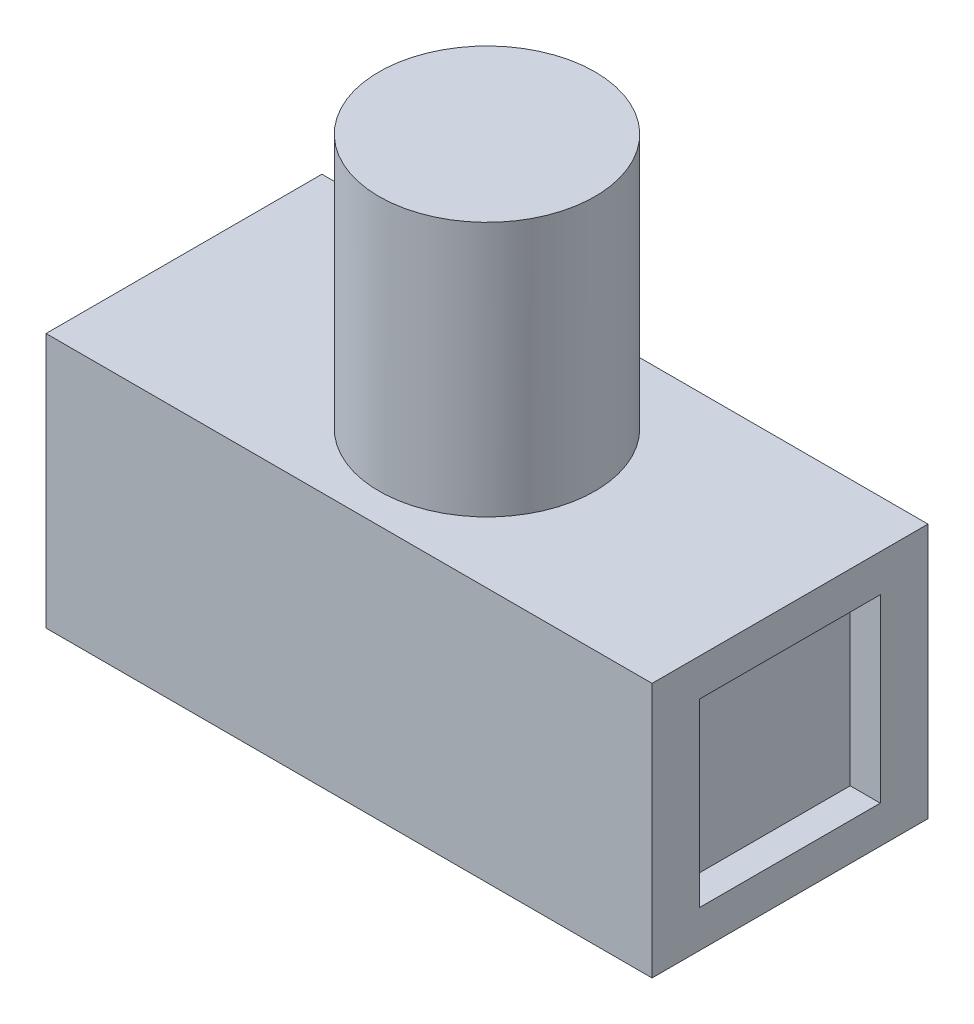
ISO-10303-21;
HEADER;
FILE_DESCRIPTION(('STEP AP214'),'2;1');
FILE_NAME('part.step','',(''),(''),'','','');
FILE_SCHEMA(('AUTOMOTIVE_DESIGN { 1 0 10303 214 1 1 1 1 }'));
ENDSEC;
DATA;
#1=APPLICATION_CONTEXT('core data for automotive mechanical design processes');
#2=APPLICATION_PROTOCOL_DEFINITION('international standard','automotive_design',2000,#1);
#3=PRODUCT_CONTEXT('',#1,'mechanical');
#4=PRODUCT('Part','Part','',(#3));
#5=PRODUCT_RELATED_PRODUCT_CATEGORY('part','',(#4));
#6=PRODUCT_DEFINITION_FORMATION('','',#4);
#7=PRODUCT_DEFINITION_CONTEXT('part definition',#1,'design');
#8=PRODUCT_DEFINITION('design','',#6,#7);
#9=PRODUCT_DEFINITION_SHAPE('','',#8);
#10=(LENGTH_UNIT() NAMED_UNIT(*) SI_UNIT(.MILLI.,.METRE.));
#11=(NAMED_UNIT(*) PLANE_ANGLE_UNIT() SI_UNIT($,.RADIAN.));
#12=(NAMED_UNIT(*) SI_UNIT($,.STERADIAN.) SOLID_ANGLE_UNIT());
#13=UNCERTAINTY_MEASURE_WITH_UNIT(LENGTH_MEASURE(1.E-05),#10,'distance_accuracy_value','');
#14=(GEOMETRIC_REPRESENTATION_CONTEXT(3) GLOBAL_UNCERTAINTY_ASSIGNED_CONTEXT((#13)) GLOBAL_UNIT_ASSIGNED_CONTEXT((#10,
#11,#12)) REPRESENTATION_CONTEXT('',''));
#15=CARTESIAN_POINT('',(0.,0.,0.));
#16=DIRECTION('',(0.,0.,1.));
#17=DIRECTION('',(1.,0.,0.));
#18=AXIS2_PLACEMENT_3D('',#15,#16,#17);
#19=CARTESIAN_POINT('',(0.,53.848,0.));
#20=DIRECTION('',(0.,-1.,0.));
#21=DIRECTION('',(0.,0.,-1.));
#22=AXIS2_PLACEMENT_3D('',#19,#20,#21);
#23=PLANE('',#22);
#24=DIRECTION('',(0.,0.,1.));
#25=VECTOR('',#24,1.);
#26=CARTESIAN_POINT('',(-63.9482717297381,53.848,29.1126373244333));
#27=LINE('',#26,#25);
#28=CARTESIAN_POINT('',(-63.9482717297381,53.848,-29.1126373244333));
#29=VERTEX_POINT('',#28);
#30=CARTESIAN_POINT('',(-63.9482717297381,53.848,29.1126373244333));
#31=VERTEX_POINT('',#30);
#32=EDGE_CURVE('E152',#29,#31,#27,.T.);
#33=ORIENTED_EDGE('',*,*,#32,.T.);
#34=DIRECTION('',(1.,0.,0.));
#35=VECTOR('',#34,1.);
#36=CARTESIAN_POINT('',(-63.9482717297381,53.848,29.1126373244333));
#37=LINE('',#36,#35);
#38=CARTESIAN_POINT('',(63.9482717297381,53.848,29.1126373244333));
#39=VERTEX_POINT('',#38);
#40=EDGE_CURVE('E88',#31,#39,#37,.T.);
#41=ORIENTED_EDGE('',*,*,#40,.T.);
#42=DIRECTION('',(0.,0.,-1.));
#43=VECTOR('',#42,1.);
#44=CARTESIAN_POINT('',(63.9482717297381,53.848,29.1126373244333));
#45=LINE('',#44,#43);
#46=CARTESIAN_POINT('',(63.9482717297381,53.848,-29.1126373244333));
#47=VERTEX_POINT('',#46);
#48=EDGE_CURVE('E155',#39,#47,#45,.T.);
#49=ORIENTED_EDGE('',*,*,#48,.T.);
#50=DIRECTION('',(-1.,0.,0.));
#51=VECTOR('',#50,1.);
#52=CARTESIAN_POINT('',(-63.9482717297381,53.848,-29.1126373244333));
#53=LINE('',#52,#51);
#54=EDGE_CURVE('E59',#47,#29,#53,.T.);
#55=ORIENTED_EDGE('',*,*,#54,.T.);
#56=EDGE_LOOP('',(#33,#41,#49,#55));
#57=FACE_BOUND('',#56,.T.);
#58=CARTESIAN_POINT('',(0.,53.848,0.));
#59=DIRECTION('',(0.,-1.,0.));
#60=DIRECTION('',(0.,0.,-1.));
#61=AXIS2_PLACEMENT_3D('',#58,#59,#60);
#62=CIRCLE('',#61,22.7944784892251);
#63=CARTESIAN_POINT('',(0.,53.848,-22.7944784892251));
#64=VERTEX_POINT('',#63);
#65=EDGE_CURVE('E11',#64,#64,#62,.F.);
#66=ORIENTED_EDGE('',*,*,#65,.F.);
#67=EDGE_LOOP('',(#66));
#68=FACE_BOUND('',#67,.T.);
#69=ADVANCED_FACE('F35',(#57,#68),#23,.F.);
#70=CARTESIAN_POINT('',(-63.9482717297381,53.848,29.1126373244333));
#71=DIRECTION('',(1.,0.,0.));
#72=DIRECTION('',(0.,0.,-1.));
#73=AXIS2_PLACEMENT_3D('',#70,#71,#72);
#74=PLANE('',#73);
#75=DIRECTION('',(0.,0.,1.));
#76=VECTOR('',#75,1.);
#77=CARTESIAN_POINT('',(-63.9482717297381,0.,29.1126373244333));
#78=LINE('',#77,#76);
#79=CARTESIAN_POINT('',(-63.9482717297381,0.,-29.1126373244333));
#80=VERTEX_POINT('',#79);
#81=CARTESIAN_POINT('',(-63.9482717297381,0.,29.1126373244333));
#82=VERTEX_POINT('',#81);
#83=EDGE_CURVE('E151',#80,#82,#78,.T.);
#84=ORIENTED_EDGE('',*,*,#83,.T.);
#85=DIRECTION('',(0.,-1.,0.));
#86=VECTOR('',#85,1.);
#87=CARTESIAN_POINT('',(-63.9482717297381,53.848,29.1126373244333));
#88=LINE('',#87,#86);
#89=EDGE_CURVE('E43',#31,#82,#88,.T.);
#90=ORIENTED_EDGE('',*,*,#89,.F.);
#91=ORIENTED_EDGE('',*,*,#32,.F.);
#92=DIRECTION('',(0.,-1.,0.));
#93=VECTOR('',#92,1.);
#94=CARTESIAN_POINT('',(-63.9482717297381,53.848,-29.1126373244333));
#95=LINE('',#94,#93);
#96=EDGE_CURVE('E158',#29,#80,#95,.T.);
#97=ORIENTED_EDGE('',*,*,#96,.T.);
#98=EDGE_LOOP('',(#84,#90,#91,#97));
#99=FACE_BOUND('',#98,.T.);
#100=ADVANCED_FACE('F37',(#99),#74,.F.);
#101=CARTESIAN_POINT('',(-63.9482717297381,53.848,29.1126373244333));
#102=DIRECTION('',(0.,0.,-1.));
#103=DIRECTION('',(-1.,0.,0.));
#104=AXIS2_PLACEMENT_3D('',#101,#102,#103);
#105=PLANE('',#104);
#106=DIRECTION('',(1.,0.,0.));
#107=VECTOR('',#106,1.);
#108=CARTESIAN_POINT('',(-63.9482717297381,0.,29.1126373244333));
#109=LINE('',#108,#107);
#110=CARTESIAN_POINT('',(63.9482717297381,0.,29.1126373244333));
#111=VERTEX_POINT('',#110);
#112=EDGE_CURVE('E161',#82,#111,#109,.T.);
#113=ORIENTED_EDGE('',*,*,#112,.T.);
#114=DIRECTION('',(0.,-1.,0.));
#115=VECTOR('',#114,1.);
#116=CARTESIAN_POINT('',(63.9482717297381,53.848,29.1126373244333));
#117=LINE('',#116,#115);
#118=EDGE_CURVE('E169',#39,#111,#117,.T.);
#119=ORIENTED_EDGE('',*,*,#118,.F.);
#120=ORIENTED_EDGE('',*,*,#40,.F.);
#121=ORIENTED_EDGE('',*,*,#89,.T.);
#122=EDGE_LOOP('',(#113,#119,#120,#121));
#123=FACE_BOUND('',#122,.T.);
#124=ADVANCED_FACE('F172',(#123),#105,.F.);
#125=CARTESIAN_POINT('',(63.9482717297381,53.848,29.1126373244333));
#126=DIRECTION('',(-1.,0.,0.));
#127=DIRECTION('',(0.,0.,1.));
#128=AXIS2_PLACEMENT_3D('',#125,#126,#127);
#129=PLANE('',#128);
#130=DIRECTION('',(0.,0.,-1.));
#131=VECTOR('',#130,1.);
#132=CARTESIAN_POINT('',(63.9482717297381,7.87400000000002,19.05));
#133=LINE('',#132,#131);
#134=CARTESIAN_POINT('',(63.9482717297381,7.87400000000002,19.05));
#135=VERTEX_POINT('',#134);
#136=CARTESIAN_POINT('',(63.9482717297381,7.87400000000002,-19.05));
#137=VERTEX_POINT('',#136);
#138=EDGE_CURVE('E139',#135,#137,#133,.T.);
#139=ORIENTED_EDGE('',*,*,#138,.F.);
#140=DIRECTION('',(0.,-1.,0.));
#141=VECTOR('',#140,1.);
#142=CARTESIAN_POINT('',(63.9482717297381,45.974,19.05));
#143=LINE('',#142,#141);
#144=CARTESIAN_POINT('',(63.9482717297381,45.974,19.05));
#145=VERTEX_POINT('',#144);
#146=EDGE_CURVE('E50',#145,#135,#143,.T.);
#147=ORIENTED_EDGE('',*,*,#146,.F.);
#148=DIRECTION('',(0.,0.,1.));
#149=VECTOR('',#148,1.);
#150=CARTESIAN_POINT('',(63.9482717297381,45.974,19.05));
#151=LINE('',#150,#149);
#152=CARTESIAN_POINT('',(63.9482717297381,45.974,-19.05));
#153=VERTEX_POINT('',#152);
#154=EDGE_CURVE('E130',#153,#145,#151,.T.);
#155=ORIENTED_EDGE('',*,*,#154,.F.);
#156=DIRECTION('',(0.,1.,0.));
#157=VECTOR('',#156,1.);
#158=CARTESIAN_POINT('',(63.9482717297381,45.974,-19.05));
#159=LINE('',#158,#157);
#160=EDGE_CURVE('E133',#137,#153,#159,.T.);
#161=ORIENTED_EDGE('',*,*,#160,.F.);
#162=EDGE_LOOP('',(#139,#147,#155,#161));
#163=FACE_BOUND('',#162,.T.);
#164=DIRECTION('',(0.,0.,-1.));
#165=VECTOR('',#164,1.);
#166=CARTESIAN_POINT('',(63.9482717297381,0.,29.1126373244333));
#167=LINE('',#166,#165);
#168=CARTESIAN_POINT('',(63.9482717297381,0.,-29.1126373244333));
#169=VERTEX_POINT('',#168);
#170=EDGE_CURVE('E163',#111,#169,#167,.T.);
#171=ORIENTED_EDGE('',*,*,#170,.T.);
#172=DIRECTION('',(0.,-1.,0.));
#173=VECTOR('',#172,1.);
#174=CARTESIAN_POINT('',(63.9482717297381,53.848,-29.1126373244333));
#175=LINE('',#174,#173);
#176=EDGE_CURVE('E167',#47,#169,#175,.T.);
#177=ORIENTED_EDGE('',*,*,#176,.F.);
#178=ORIENTED_EDGE('',*,*,#48,.F.);
#179=ORIENTED_EDGE('',*,*,#118,.T.);
#180=EDGE_LOOP('',(#171,#177,#178,#179));
#181=FACE_BOUND('',#180,.T.);
#182=ADVANCED_FACE('F181',(#163,#181),#129,.F.);
#183=CARTESIAN_POINT('',(-63.9482717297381,53.848,-29.1126373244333));
#184=DIRECTION('',(0.,0.,1.));
#185=DIRECTION('',(1.,0.,0.));
#186=AXIS2_PLACEMENT_3D('',#183,#184,#185);
#187=PLANE('',#186);
#188=DIRECTION('',(-1.,0.,0.));
#189=VECTOR('',#188,1.);
#190=CARTESIAN_POINT('',(-63.9482717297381,0.,-29.1126373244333));
#191=LINE('',#190,#189);
#192=EDGE_CURVE('E80',#169,#80,#191,.T.);
#193=ORIENTED_EDGE('',*,*,#192,.T.);
#194=ORIENTED_EDGE('',*,*,#96,.F.);
#195=ORIENTED_EDGE('',*,*,#54,.F.);
#196=ORIENTED_EDGE('',*,*,#176,.T.);
#197=EDGE_LOOP('',(#193,#194,#195,#196));
#198=FACE_BOUND('',#197,.T.);
#199=ADVANCED_FACE('F183',(#198),#187,.F.);
#200=CARTESIAN_POINT('',(0.,0.,0.));
#201=DIRECTION('',(0.,-1.,0.));
#202=DIRECTION('',(0.,0.,-1.));
#203=AXIS2_PLACEMENT_3D('',#200,#201,#202);
#204=PLANE('',#203);
#205=ORIENTED_EDGE('',*,*,#83,.F.);
#206=ORIENTED_EDGE('',*,*,#192,.F.);
#207=ORIENTED_EDGE('',*,*,#170,.F.);
#208=ORIENTED_EDGE('',*,*,#112,.F.);
#209=EDGE_LOOP('',(#205,#206,#207,#208));
#210=FACE_BOUND('',#209,.T.);
#211=ADVANCED_FACE('F177',(#210),#204,.T.);
#212=CARTESIAN_POINT('',(0.,107.696,0.));
#213=DIRECTION('',(0.,-1.,0.));
#214=DIRECTION('',(0.,0.,-1.));
#215=AXIS2_PLACEMENT_3D('',#212,#213,#214);
#216=CYLINDRICAL_SURFACE('',#215,22.7944784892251);
#217=CARTESIAN_POINT('',(0.,107.696,0.));
#218=DIRECTION('',(0.,1.,0.));
#219=DIRECTION('',(0.,0.,1.));
#220=AXIS2_PLACEMENT_3D('',#217,#218,#219);
#221=CIRCLE('',#220,22.7944784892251);
#222=CARTESIAN_POINT('',(0.,107.696,22.7944784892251));
#223=VERTEX_POINT('',#222);
#224=EDGE_CURVE('E145',#223,#223,#221,.T.);
#225=ORIENTED_EDGE('',*,*,#224,.F.);
#226=EDGE_LOOP('',(#225));
#227=FACE_BOUND('',#226,.T.);
#228=ORIENTED_EDGE('',*,*,#65,.T.);
#229=EDGE_LOOP('',(#228));
#230=FACE_BOUND('',#229,.T.);
#231=ADVANCED_FACE('F189',(#227,#230),#216,.T.);
#232=CARTESIAN_POINT('',(0.,107.696,0.));
#233=DIRECTION('',(0.,1.,0.));
#234=DIRECTION('',(0.,0.,1.));
#235=AXIS2_PLACEMENT_3D('',#232,#233,#234);
#236=PLANE('',#235);
#237=ORIENTED_EDGE('',*,*,#224,.T.);
#238=EDGE_LOOP('',(#237));
#239=FACE_BOUND('',#238,.T.);
#240=ADVANCED_FACE('F191',(#239),#236,.T.);
#241=CARTESIAN_POINT('',(57.5982717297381,45.974,19.05));
#242=DIRECTION('',(0.,0.,1.));
#243=DIRECTION('',(0.,-1.,0.));
#244=AXIS2_PLACEMENT_3D('',#241,#242,#243);
#245=PLANE('',#244);
#246=ORIENTED_EDGE('',*,*,#146,.T.);
#247=DIRECTION('',(1.,0.,0.));
#248=VECTOR('',#247,1.);
#249=CARTESIAN_POINT('',(57.5982717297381,7.87400000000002,19.05));
#250=LINE('',#249,#248);
#251=CARTESIAN_POINT('',(57.5982717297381,7.87400000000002,19.05));
#252=VERTEX_POINT('',#251);
#253=EDGE_CURVE('E108',#252,#135,#250,.T.);
#254=ORIENTED_EDGE('',*,*,#253,.F.);
#255=DIRECTION('',(0.,-1.,0.));
#256=VECTOR('',#255,1.);
#257=CARTESIAN_POINT('',(57.5982717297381,45.974,19.05));
#258=LINE('',#257,#256);
#259=CARTESIAN_POINT('',(57.5982717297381,45.974,19.05));
#260=VERTEX_POINT('',#259);
#261=EDGE_CURVE('E112',#260,#252,#258,.T.);
#262=ORIENTED_EDGE('',*,*,#261,.F.);
#263=DIRECTION('',(1.,0.,0.));
#264=VECTOR('',#263,1.);
#265=CARTESIAN_POINT('',(57.5982717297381,45.974,19.05));
#266=LINE('',#265,#264);
#267=EDGE_CURVE('E143',#260,#145,#266,.T.);
#268=ORIENTED_EDGE('',*,*,#267,.T.);
#269=EDGE_LOOP('',(#246,#254,#262,#268));
#270=FACE_BOUND('',#269,.T.);
#271=ADVANCED_FACE('F110',(#270),#245,.F.);
#272=CARTESIAN_POINT('',(57.5982717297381,45.974,19.05));
#273=DIRECTION('',(0.,1.,0.));
#274=DIRECTION('',(0.,0.,1.));
#275=AXIS2_PLACEMENT_3D('',#272,#273,#274);
#276=PLANE('',#275);
#277=ORIENTED_EDGE('',*,*,#154,.T.);
#278=ORIENTED_EDGE('',*,*,#267,.F.);
#279=DIRECTION('',(0.,0.,1.));
#280=VECTOR('',#279,1.);
#281=CARTESIAN_POINT('',(57.5982717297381,45.974,19.05));
#282=LINE('',#281,#280);
#283=CARTESIAN_POINT('',(57.5982717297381,45.974,-19.05));
#284=VERTEX_POINT('',#283);
#285=EDGE_CURVE('E118',#284,#260,#282,.T.);
#286=ORIENTED_EDGE('',*,*,#285,.F.);
#287=DIRECTION('',(1.,0.,0.));
#288=VECTOR('',#287,1.);
#289=CARTESIAN_POINT('',(57.5982717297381,45.974,-19.05));
#290=LINE('',#289,#288);
#291=EDGE_CURVE('E146',#284,#153,#290,.T.);
#292=ORIENTED_EDGE('',*,*,#291,.T.);
#293=EDGE_LOOP('',(#277,#278,#286,#292));
#294=FACE_BOUND('',#293,.T.);
#295=ADVANCED_FACE('F249',(#294),#276,.F.);
#296=CARTESIAN_POINT('',(57.5982717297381,45.974,-19.05));
#297=DIRECTION('',(0.,0.,-1.));
#298=DIRECTION('',(0.,1.,0.));
#299=AXIS2_PLACEMENT_3D('',#296,#297,#298);
#300=PLANE('',#299);
#301=ORIENTED_EDGE('',*,*,#160,.T.);
#302=ORIENTED_EDGE('',*,*,#291,.F.);
#303=DIRECTION('',(0.,1.,0.));
#304=VECTOR('',#303,1.);
#305=CARTESIAN_POINT('',(57.5982717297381,45.974,-19.05));
#306=LINE('',#305,#304);
#307=CARTESIAN_POINT('',(57.5982717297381,7.87400000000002,-19.05));
#308=VERTEX_POINT('',#307);
#309=EDGE_CURVE('E126',#308,#284,#306,.T.);
#310=ORIENTED_EDGE('',*,*,#309,.F.);
#311=DIRECTION('',(1.,0.,0.));
#312=VECTOR('',#311,1.);
#313=CARTESIAN_POINT('',(57.5982717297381,7.87400000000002,-19.05));
#314=LINE('',#313,#312);
#315=EDGE_CURVE('E117',#308,#137,#314,.T.);
#316=ORIENTED_EDGE('',*,*,#315,.T.);
#317=EDGE_LOOP('',(#301,#302,#310,#316));
#318=FACE_BOUND('',#317,.T.);
#319=ADVANCED_FACE('F257',(#318),#300,.F.);
#320=CARTESIAN_POINT('',(57.5982717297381,7.87400000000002,19.05));
#321=DIRECTION('',(0.,-1.,0.));
#322=DIRECTION('',(0.,0.,-1.));
#323=AXIS2_PLACEMENT_3D('',#320,#321,#322);
#324=PLANE('',#323);
#325=ORIENTED_EDGE('',*,*,#138,.T.);
#326=ORIENTED_EDGE('',*,*,#315,.F.);
#327=DIRECTION('',(0.,0.,-1.));
#328=VECTOR('',#327,1.);
#329=CARTESIAN_POINT('',(57.5982717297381,7.87400000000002,19.05));
#330=LINE('',#329,#328);
#331=EDGE_CURVE('E121',#252,#308,#330,.T.);
#332=ORIENTED_EDGE('',*,*,#331,.F.);
#333=ORIENTED_EDGE('',*,*,#253,.T.);
#334=EDGE_LOOP('',(#325,#326,#332,#333));
#335=FACE_BOUND('',#334,.T.);
#336=ADVANCED_FACE('F122',(#335),#324,.F.);
#337=CARTESIAN_POINT('',(57.5982717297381,0.,0.));
#338=DIRECTION('',(1.,0.,0.));
#339=DIRECTION('',(0.,0.,-1.));
#340=AXIS2_PLACEMENT_3D('',#337,#338,#339);
#341=PLANE('',#340);
#342=ORIENTED_EDGE('',*,*,#261,.T.);
#343=ORIENTED_EDGE('',*,*,#331,.T.);
#344=ORIENTED_EDGE('',*,*,#309,.T.);
#345=ORIENTED_EDGE('',*,*,#285,.T.);
#346=EDGE_LOOP('',(#342,#343,#344,#345));
#347=FACE_BOUND('',#346,.T.);
#348=ADVANCED_FACE('F128',(#347),#341,.T.);
#349=CLOSED_SHELL('',(#69,#100,#124,#182,#199,#211,#231,#240,#271,#295,#319,#336,#348));
#350=MANIFOLD_SOLID_BREP('B2',#349);
#351=ADVANCED_BREP_SHAPE_REPRESENTATION('',(#18,#350),#14);
#352=SHAPE_DEFINITION_REPRESENTATION(#9,#351);
ENDSEC;
END-ISO-10303-21;
